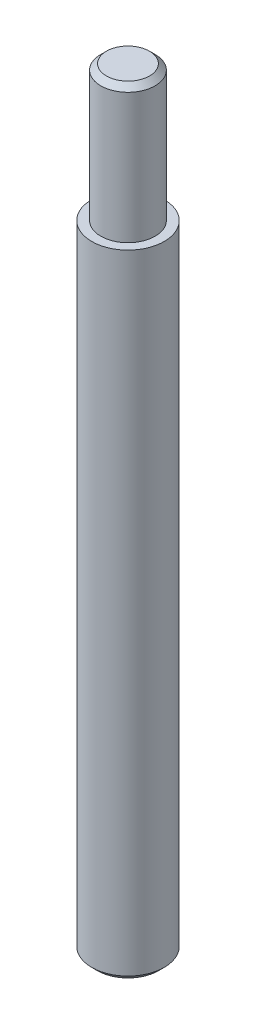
from build123d import *

# Parameters (mm, degrees)
SKETCH1_R      = 4
EXTRUDE1_DEPTH = 85
CHAMFER1_SIZE  = 0.625
SKETCH2_R      = 6.922113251
SKETCH2_R_2    = 3
EXTRUDE2_DEPTH = 15
CHAMFER2_SIZE  = 0.625


with BuildPart() as part:
    # Sketch1 → Extrude1 (new body)
    with BuildSketch(Plane(origin=(0, 0, 0), x_dir=(1, 0, 0), z_dir=(0, 1, 0))):
        with Locations(Location((0, 0, 0), (0, 0, 270))):
            Circle(SKETCH1_R)
    extrude(amount=EXTRUDE1_DEPTH)

    # Chamfer1
    chamfer1_edges = [part.edges().sort_by_distance(p)[0] for p in [
        (0, 0, -4),
        (0, 85, -4),
    ]]
    chamfer(chamfer1_edges, length=CHAMFER1_SIZE)

    # Sketch2 → Extrude2 (cut)
    with BuildSketch(Plane(origin=(0, 85, 0), x_dir=(1, 0, 0), z_dir=(0, 1, 0))):
        Circle(SKETCH2_R)
        with Locations(Location((0, 0, 0), (0, 0, 270))):
            Circle(SKETCH2_R_2, mode=Mode.SUBTRACT)
    extrude(amount=-EXTRUDE2_DEPTH, mode=Mode.SUBTRACT)

    # Chamfer2
    chamfer2_edges = [part.edges().sort_by_distance(p)[0] for p in [
        (0, 85, -3),
    ]]
    chamfer(chamfer2_edges, length=CHAMFER2_SIZE)


solid = part.part
